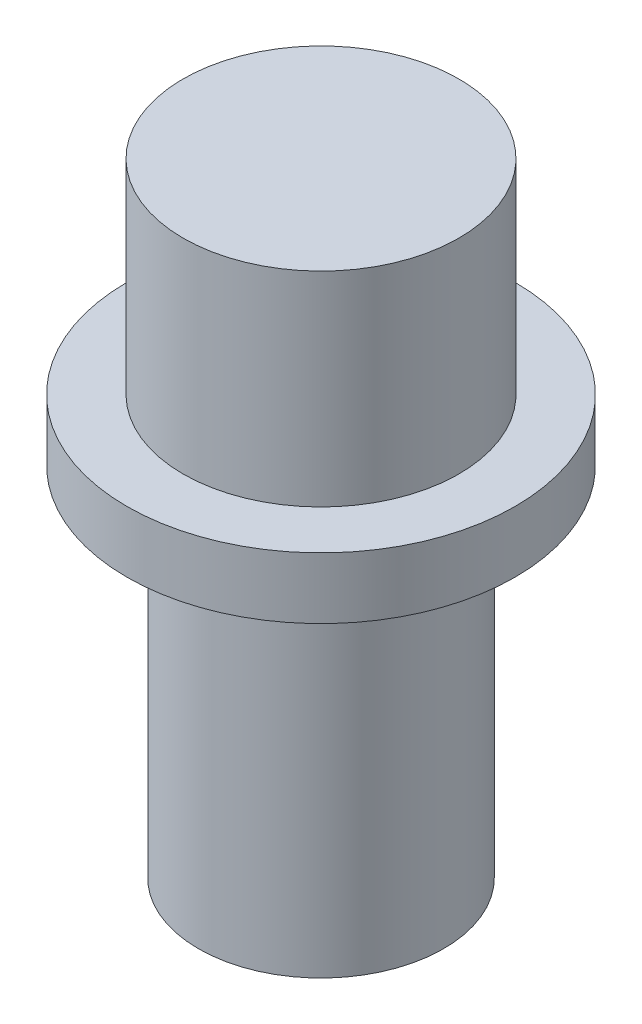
from build123d import *

# Parameters (mm, degrees)
SKETCH1_R           = 12
BOSS_EXTRUDE1_DEPTH = 35
SKETCH2_R           = 19
BOSS_EXTRUDE2_DEPTH = 6
SKETCH3_R           = 13.5
BOSS_EXTRUDE3_DEPTH = 20


with BuildPart() as part:
    # Sketch1 → Boss-Extrude1 (new body)
    with BuildSketch(Plane(origin=(0, 0, 0), x_dir=(1, 0, 0), z_dir=(0, 1, 0))):
        with Locations(Location((0, 0, 0), (0, 0, 270))):
            Circle(SKETCH1_R)
    extrude(amount=BOSS_EXTRUDE1_DEPTH)

    # Sketch2 → Boss-Extrude2 (add)
    with BuildSketch(Plane(origin=(0, 35, 0), x_dir=(1, 0, 0), z_dir=(0, 1, 0))):
        with Locations(Location((0, 0, 0), (0, 0, 270))):
            Circle(SKETCH2_R)
    extrude(amount=BOSS_EXTRUDE2_DEPTH)

    # Sketch3 → Boss-Extrude3 (add)
    with BuildSketch(Plane(origin=(0, 41, 0), x_dir=(1, 0, 0), z_dir=(0, 1, 0))):
        with Locations(Location((0, 0, 0), (0, 0, 270))):
            Circle(SKETCH3_R)
    extrude(amount=BOSS_EXTRUDE3_DEPTH)


solid = part.part
